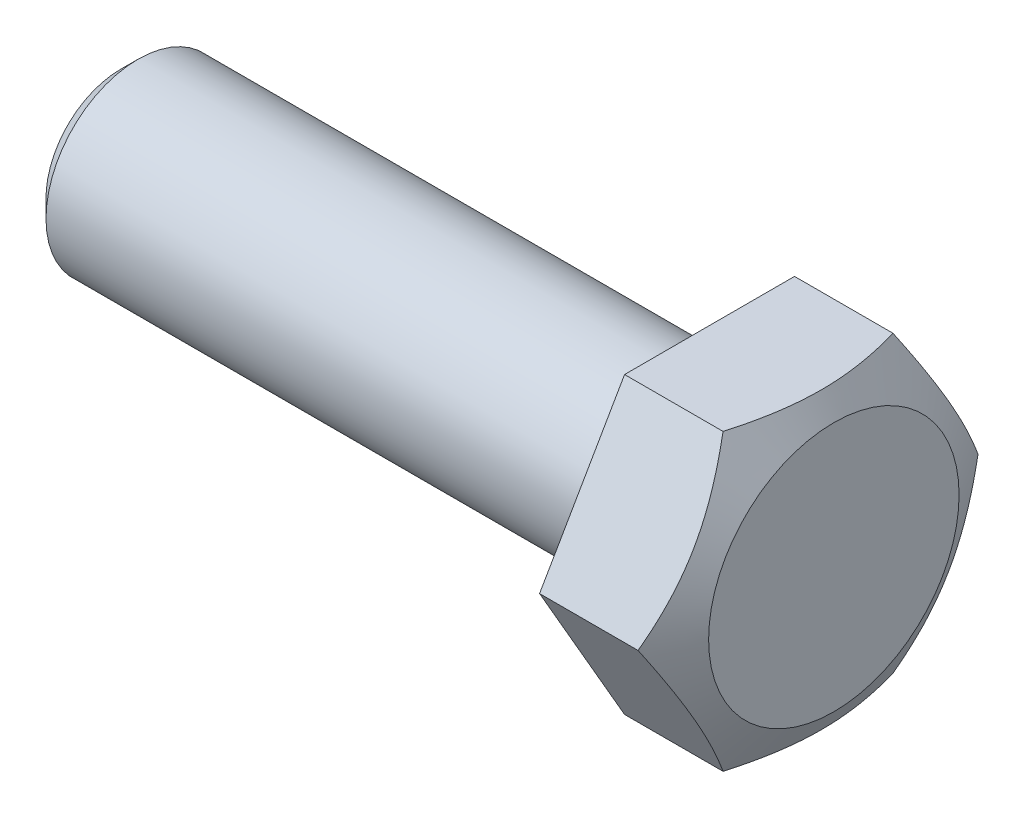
from build123d import *

# Parameters (mm, degrees)
SKETCH2_OUTSIDE_W  = 24.074
SKETCH2_OUTSIDE_H  = 24.074
CUT_EXTRUDE1_DEPTH = 6.8072


with BuildPart() as part:
    # Sketch1 → Revolve1 (revolve)
    with BuildSketch(Plane.XY):
        Polygon((30.7594, 0), (0, 0), (0, 3.20675), (0.762, 3.96875), (25.4, 3.96875), (25.4, 7.3279), (29.645860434, 7.3279), (30.7594, 5.399192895), align=None)
    revolve(axis=Axis((64.053402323, 0, 0), (-1, 0, 0)))

    # Sketch2 outside → Cut-Extrude1 (cut)
    with BuildSketch(Plane(origin=(30.7594, 0, 0), x_dir=(0, 0, -1), z_dir=(1, 0, 0))):
        Rectangle(SKETCH2_OUTSIDE_W, SKETCH2_OUTSIDE_H)
        Polygon((3.66395, -6.346147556), (7.3279, 0), (3.66395, 6.346147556), (-3.66395, 6.346147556), (-7.3279, 0), (-3.66395, -6.346147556), align=None, mode=Mode.SUBTRACT)
    extrude(amount=-CUT_EXTRUDE1_DEPTH, mode=Mode.SUBTRACT)


solid = part.part
